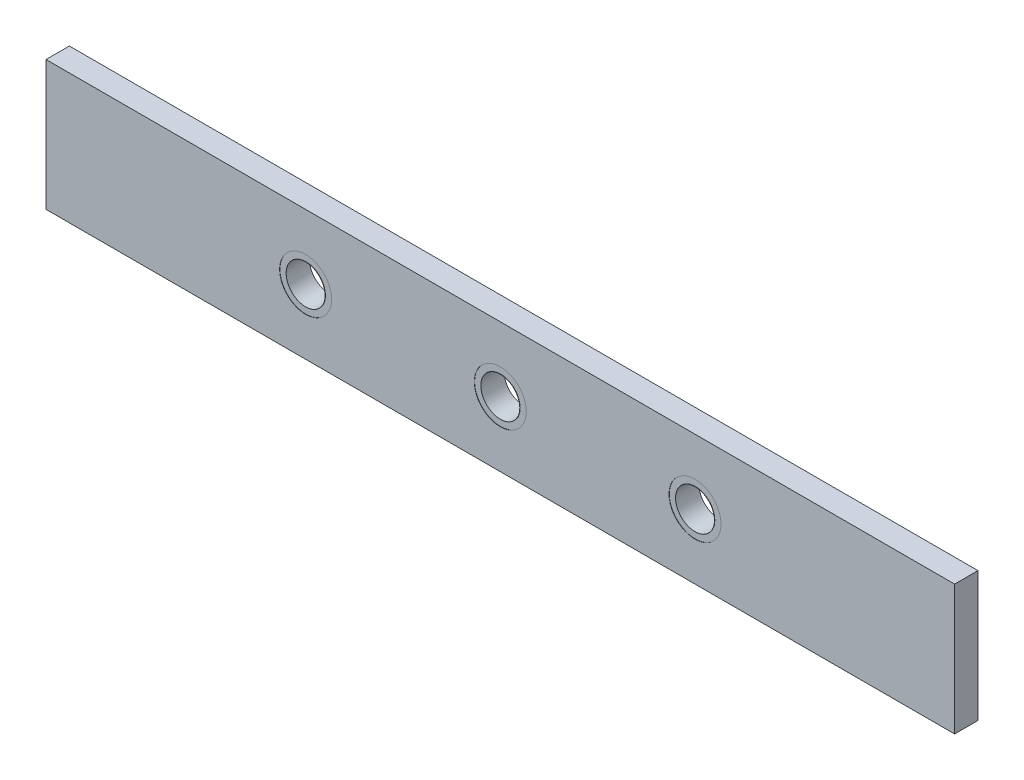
from build123d import *

# Parameters (mm, degrees)
SKETCH1_W           = 700
SKETCH1_H           = 100
BOSS_EXTRUDE1_DEPTH = 18
SKETCH2_R           = 15
CUT_EXTRUDE1_DEPTH  = 355.011299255
SKETCH4_R           = 15
CUT_EXTRUDE2_DEPTH  = 355.011299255
SKETCH5_R           = 20
SKETCH5_R_2         = 15.05
CUT_EXTRUDE3_DEPTH  = 0.2


with BuildPart() as part:
    # Sketch1 → Boss-Extrude1 (new body)
    with BuildSketch(Plane.XY):
        Rectangle(SKETCH1_W, SKETCH1_H)
    extrude(amount=BOSS_EXTRUDE1_DEPTH)

    # Sketch2 → Cut-Extrude1 (cut, through all)
    with BuildSketch(Plane.XY.offset(18)):
        with Locations((150, 0)):
            Circle(SKETCH2_R)
        with Locations(Location((-150, 0, 0), (0, 0, 180))):
            Circle(SKETCH2_R)
    extrude(amount=-CUT_EXTRUDE1_DEPTH, mode=Mode.SUBTRACT)

    # Sketch4 → Cut-Extrude2 (cut, through all)
    with BuildSketch(Plane.XY.offset(18)):
        Circle(SKETCH4_R)
    extrude(amount=-CUT_EXTRUDE2_DEPTH, mode=Mode.SUBTRACT)

    # Sketch5 → Cut-Extrude3 (cut)
    # profile 1 of 3: a face of its own
    with BuildSketch(Plane.XY.offset(18)):
        with Locations((150, 0)):
            Circle(SKETCH5_R)
        with Locations((150, 0)):
            Circle(SKETCH5_R_2, mode=Mode.SUBTRACT)
    # profile 2 of 3: a face of its own
    with BuildSketch(Plane.XY.offset(18)):
        Circle(SKETCH5_R)
        Circle(SKETCH5_R_2, mode=Mode.SUBTRACT)
    # profile 3 of 3: a face of its own
    with BuildSketch(Plane.XY.offset(18)):
        with Locations((-150, 0)):
            Circle(SKETCH5_R)
        with Locations((-150, 0)):
            Circle(SKETCH5_R_2, mode=Mode.SUBTRACT)
    cut_extrude3 = extrude(amount=-CUT_EXTRUDE3_DEPTH, mode=Mode.SUBTRACT)

    # Mirror1: Cut-Extrude3 across plane
    add(cut_extrude3.mirror(Plane.XY.offset(9)), mode=Mode.SUBTRACT)


solid = part.part
